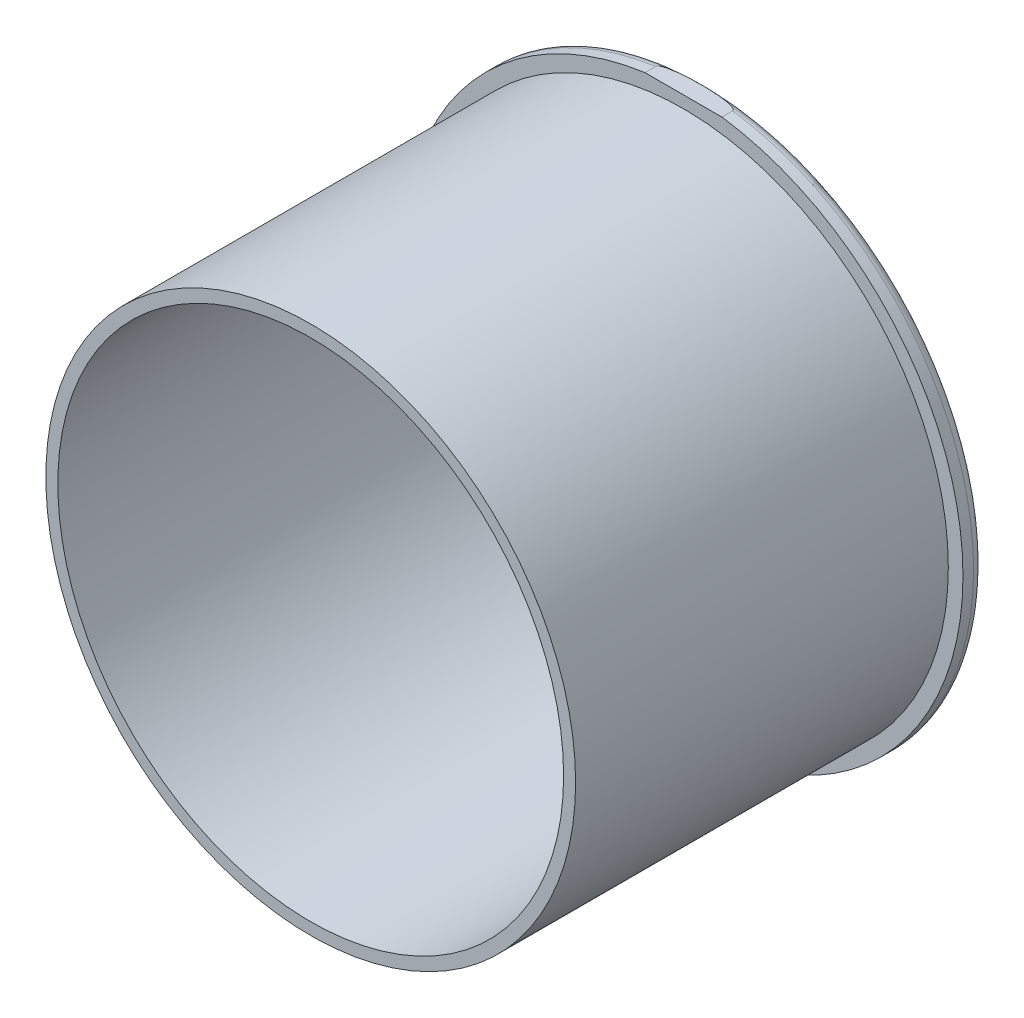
ISO-10303-21;
HEADER;
FILE_DESCRIPTION(('STEP AP214'),'2;1');
FILE_NAME('part.step','',(''),(''),'','','');
FILE_SCHEMA(('AUTOMOTIVE_DESIGN { 1 0 10303 214 1 1 1 1 }'));
ENDSEC;
DATA;
#1=APPLICATION_CONTEXT('core data for automotive mechanical design processes');
#2=APPLICATION_PROTOCOL_DEFINITION('international standard','automotive_design',2000,#1);
#3=PRODUCT_CONTEXT('',#1,'mechanical');
#4=PRODUCT('Part','Part','',(#3));
#5=PRODUCT_RELATED_PRODUCT_CATEGORY('part','',(#4));
#6=PRODUCT_DEFINITION_FORMATION('','',#4);
#7=PRODUCT_DEFINITION_CONTEXT('part definition',#1,'design');
#8=PRODUCT_DEFINITION('design','',#6,#7);
#9=PRODUCT_DEFINITION_SHAPE('','',#8);
#10=(LENGTH_UNIT() NAMED_UNIT(*) SI_UNIT(.MILLI.,.METRE.));
#11=(NAMED_UNIT(*) PLANE_ANGLE_UNIT() SI_UNIT($,.RADIAN.));
#12=(NAMED_UNIT(*) SI_UNIT($,.STERADIAN.) SOLID_ANGLE_UNIT());
#13=UNCERTAINTY_MEASURE_WITH_UNIT(LENGTH_MEASURE(1.E-05),#10,'distance_accuracy_value','');
#14=(GEOMETRIC_REPRESENTATION_CONTEXT(3) GLOBAL_UNCERTAINTY_ASSIGNED_CONTEXT((#13)) GLOBAL_UNIT_ASSIGNED_CONTEXT((#10,
#11,#12)) REPRESENTATION_CONTEXT('',''));
#15=CARTESIAN_POINT('',(0.,0.,0.));
#16=DIRECTION('',(0.,0.,1.));
#17=DIRECTION('',(1.,0.,0.));
#18=AXIS2_PLACEMENT_3D('',#15,#16,#17);
#19=CARTESIAN_POINT('',(0.,0.,0.));
#20=DIRECTION('',(0.,0.,-1.));
#21=DIRECTION('',(-1.,0.,0.));
#22=AXIS2_PLACEMENT_3D('',#19,#20,#21);
#23=PLANE('',#22);
#24=CARTESIAN_POINT('',(0.,0.,0.));
#25=DIRECTION('',(0.,0.,1.));
#26=DIRECTION('',(0.479425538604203,0.877582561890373,0.));
#27=AXIS2_PLACEMENT_3D('',#24,#25,#26);
#28=CIRCLE('',#27,5.05000000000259);
#29=CARTESIAN_POINT('',(2.42109896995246,4.43179193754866,0.));
#30=VERTEX_POINT('',#29);
#31=EDGE_CURVE('E72',#30,#30,#28,.T.);
#32=ORIENTED_EDGE('',*,*,#31,.F.);
#33=EDGE_LOOP('',(#32));
#34=FACE_BOUND('',#33,.T.);
#35=ADVANCED_FACE('F16',(#34),#23,.T.);
#36=CARTESIAN_POINT('',(0.,4.75,0.25));
#37=DIRECTION('',(0.,0.,-1.));
#38=DIRECTION('',(-1.,0.,0.));
#39=AXIS2_PLACEMENT_3D('',#36,#37,#38);
#40=PLANE('',#39);
#41=CARTESIAN_POINT('',(0.,0.,0.25));
#42=DIRECTION('',(0.,0.,1.));
#43=DIRECTION('',(1.,0.,0.));
#44=AXIS2_PLACEMENT_3D('',#41,#42,#43);
#45=CIRCLE('',#44,4.75);
#46=CARTESIAN_POINT('',(4.75,0.,0.25));
#47=VERTEX_POINT('',#46);
#48=EDGE_CURVE('E81',#47,#47,#45,.T.);
#49=ORIENTED_EDGE('',*,*,#48,.T.);
#50=EDGE_LOOP('',(#49));
#51=FACE_BOUND('',#50,.T.);
#52=ADVANCED_FACE('F119',(#51),#40,.F.);
#53=CARTESIAN_POINT('',(0.,0.,0.2));
#54=DIRECTION('',(0.,0.,-1.));
#55=DIRECTION('',(0.479425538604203,0.877582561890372,0.));
#56=AXIS2_PLACEMENT_3D('',#53,#54,#55);
#57=TOROIDAL_SURFACE('',#56,5.05,0.2);
#58=ORIENTED_EDGE('',*,*,#31,.T.);
#59=EDGE_LOOP('',(#58));
#60=FACE_BOUND('',#59,.T.);
#61=CARTESIAN_POINT('',(0.,0.,0.2));
#62=DIRECTION('',(0.,0.,1.));
#63=DIRECTION('',(1.,0.,0.));
#64=AXIS2_PLACEMENT_3D('',#61,#62,#63);
#65=CIRCLE('',#64,5.25);
#66=CARTESIAN_POINT('',(-0.722841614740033,5.2,0.2));
#67=VERTEX_POINT('',#66);
#68=CARTESIAN_POINT('',(-0.722841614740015,-5.2,0.2));
#69=VERTEX_POINT('',#68);
#70=EDGE_CURVE('E70',#67,#69,#65,.T.);
#71=ORIENTED_EDGE('',*,*,#70,.F.);
#72=CARTESIAN_POINT('',(-0.722841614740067,5.2,0.2));
#73=CARTESIAN_POINT('',(-0.722858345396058,5.2,0.196452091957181));
#74=CARTESIAN_POINT('',(-0.722160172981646,5.2,0.19304530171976));
#75=CARTESIAN_POINT('',(-0.719410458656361,5.2,0.185678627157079));
#76=CARTESIAN_POINT('',(-0.717033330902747,5.2,0.181832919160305));
#77=CARTESIAN_POINT('',(-0.711778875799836,5.2,0.175244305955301));
#78=CARTESIAN_POINT('',(-0.708980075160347,5.2,0.172428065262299));
#79=CARTESIAN_POINT('',(-0.703025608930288,5.2,0.16718922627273));
#80=CARTESIAN_POINT('',(-0.699869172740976,5.2,0.164767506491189));
#81=CARTESIAN_POINT('',(-0.691454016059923,5.2,0.158909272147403));
#82=CARTESIAN_POINT('',(-0.686040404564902,5.2,0.155701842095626));
#83=CARTESIAN_POINT('',(-0.674957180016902,5.2,0.149792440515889));
#84=CARTESIAN_POINT('',(-0.669287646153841,5.2,0.147090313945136));
#85=CARTESIAN_POINT('',(-0.651978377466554,5.2,0.139488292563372));
#86=CARTESIAN_POINT('',(-0.640103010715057,5.2,0.135131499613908));
#87=CARTESIAN_POINT('',(-0.615000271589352,5.2,0.126922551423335));
#88=CARTESIAN_POINT('',(-0.601747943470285,5.2,0.123151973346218));
#89=CARTESIAN_POINT('',(-0.57506202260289,5.2,0.116306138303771));
#90=CARTESIAN_POINT('',(-0.561628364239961,5.2,0.113231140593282));
#91=CARTESIAN_POINT('',(-0.521117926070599,5.2,0.104749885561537));
#92=CARTESIAN_POINT('',(-0.493884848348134,5.2,0.10010270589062));
#93=CARTESIAN_POINT('',(-0.439244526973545,5.2,0.0920807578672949));
#94=CARTESIAN_POINT('',(-0.411837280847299,5.19999999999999,0.0887060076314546));
#95=CARTESIAN_POINT('',(-0.35695832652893,5.20000000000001,0.0828896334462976));
#96=CARTESIAN_POINT('',(-0.329486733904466,5.20000000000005,0.0804469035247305));
#97=CARTESIAN_POINT('',(-0.274001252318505,5.19999999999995,0.0762486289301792));
#98=CARTESIAN_POINT('',(-0.245986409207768,5.1999999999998,0.0745060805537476));
#99=CARTESIAN_POINT('',(-0.189916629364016,5.2000000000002,0.0716476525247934));
#100=CARTESIAN_POINT('',(-0.161861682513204,5.20000000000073,0.0705319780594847));
#101=CARTESIAN_POINT('',(-0.0777740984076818,5.19999999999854,0.0680088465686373));
#102=CARTESIAN_POINT('',(-0.021715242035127,5.19999999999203,0.0674181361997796));
#103=CARTESIAN_POINT('',(0.072383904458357,5.19999999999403,0.0681281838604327));
#104=CARTESIAN_POINT('',(0.110429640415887,5.19999999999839,0.0688824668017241));
#105=CARTESIAN_POINT('',(0.186498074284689,5.20000000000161,0.0714267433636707));
#106=CARTESIAN_POINT('',(0.224520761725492,5.20000000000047,0.0732170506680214));
#107=CARTESIAN_POINT('',(0.314091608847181,5.19999999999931,0.0788903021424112));
#108=CARTESIAN_POINT('',(0.365611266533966,5.19999999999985,0.0832928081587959));
#109=CARTESIAN_POINT('',(0.451918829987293,5.2000000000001,0.0936942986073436));
#110=CARTESIAN_POINT('',(0.486815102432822,5.20000000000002,0.0987397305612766));
#111=CARTESIAN_POINT('',(0.545243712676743,5.19999999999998,0.109559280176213));
#112=CARTESIAN_POINT('',(0.568902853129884,5.2,0.114606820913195));
#113=CARTESIAN_POINT('',(0.608457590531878,5.2,0.124974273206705));
#114=CARTESIAN_POINT('',(0.624495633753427,5.20000000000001,0.129729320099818));
#115=CARTESIAN_POINT('',(0.651244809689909,5.2,0.139294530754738));
#116=CARTESIAN_POINT('',(0.662105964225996,5.19999999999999,0.143657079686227));
#117=CARTESIAN_POINT('',(0.678263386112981,5.20000000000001,0.151478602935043));
#118=CARTESIAN_POINT('',(0.683806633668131,5.20000000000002,0.154419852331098));
#119=CARTESIAN_POINT('',(0.694513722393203,5.19999999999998,0.160916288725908));
#120=CARTESIAN_POINT('',(0.699679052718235,5.19999999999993,0.164468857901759));
#121=CARTESIAN_POINT('',(0.708278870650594,5.19999999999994,0.171685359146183));
#122=CARTESIAN_POINT('',(0.71185196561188,5.19999999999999,0.175180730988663));
#123=CARTESIAN_POINT('',(0.717973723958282,5.20000000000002,0.183195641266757));
#124=CARTESIAN_POINT('',(0.72051052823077,5.2,0.187726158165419));
#125=CARTESIAN_POINT('',(0.722498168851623,5.2,0.194977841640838));
#126=CARTESIAN_POINT('',(0.722859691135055,5.2,0.197461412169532));
#127=CARTESIAN_POINT('',(0.722841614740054,5.2,0.199999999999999));
#128=B_SPLINE_CURVE_WITH_KNOTS('',3,(#72,#73,#74,#75,#76,#77,#78,#79,#80,#81,#82,#83,#84,#85,
#86,#87,#88,#89,#90,#91,#92,#93,#94,#95,#96,#97,#98,#99,#100,#101,#102,#103,#104,#105,#106,#107,
#108,#109,#110,#111,#112,#113,#114,#115,#116,#117,#118,#119,#120,#121,#122,#123,#124,#125,#126,
#127),.UNSPECIFIED.,.F.,.F.,(4,2,2,2,2,2,2,2,2,2,2,2,2,2,2,2,2,2,2,2,2,2,2,2,2,2,2,4),(0.,
0.0103569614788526,0.0236287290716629,0.0355096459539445,0.0474166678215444,0.0662496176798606,
0.085076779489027,0.122956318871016,0.164270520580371,0.205600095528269,0.288424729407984,
0.37125054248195,0.453977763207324,0.538176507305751,0.622402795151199,0.790544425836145,
0.904692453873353,1.01887506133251,1.1739140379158,1.27962687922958,1.35213747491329,
1.40226886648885,1.43730705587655,1.45611268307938,1.47483969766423,1.48977048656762,
1.50486765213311,1.51236305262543),.UNSPECIFIED.);
#129=CARTESIAN_POINT('',(0.722841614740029,5.2,0.2));
#130=VERTEX_POINT('',#129);
#131=EDGE_CURVE('E20',#67,#130,#128,.T.);
#132=ORIENTED_EDGE('',*,*,#131,.T.);
#133=CARTESIAN_POINT('',(0.,0.,0.2));
#134=DIRECTION('',(0.,0.,1.));
#135=DIRECTION('',(1.,0.,0.));
#136=AXIS2_PLACEMENT_3D('',#133,#134,#135);
#137=CIRCLE('',#136,5.25);
#138=CARTESIAN_POINT('',(0.72284161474,-5.2,0.2));
#139=VERTEX_POINT('',#138);
#140=EDGE_CURVE('E67',#139,#130,#137,.T.);
#141=ORIENTED_EDGE('',*,*,#140,.F.);
#142=CARTESIAN_POINT('',(0.722841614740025,-5.2,0.2));
#143=CARTESIAN_POINT('',(0.722858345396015,-5.2,0.19645209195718));
#144=CARTESIAN_POINT('',(0.722160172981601,-5.2,0.193045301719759));
#145=CARTESIAN_POINT('',(0.719410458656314,-5.2,0.185678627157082));
#146=CARTESIAN_POINT('',(0.717033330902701,-5.2,0.18183291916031));
#147=CARTESIAN_POINT('',(0.711778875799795,-5.2,0.175244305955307));
#148=CARTESIAN_POINT('',(0.708980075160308,-5.2,0.172428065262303));
#149=CARTESIAN_POINT('',(0.703025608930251,-5.2,0.167189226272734));
#150=CARTESIAN_POINT('',(0.699869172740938,-5.2,0.164767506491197));
#151=CARTESIAN_POINT('',(0.691454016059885,-5.2,0.158909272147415));
#152=CARTESIAN_POINT('',(0.686040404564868,-5.2,0.155701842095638));
#153=CARTESIAN_POINT('',(0.674957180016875,-5.2,0.1497924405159));
#154=CARTESIAN_POINT('',(0.669287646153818,-5.2,0.147090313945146));
#155=CARTESIAN_POINT('',(0.651978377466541,-5.2,0.139488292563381));
#156=CARTESIAN_POINT('',(0.640103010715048,-5.2,0.135131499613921));
#157=CARTESIAN_POINT('',(0.615000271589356,-5.2,0.126922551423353));
#158=CARTESIAN_POINT('',(0.601747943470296,-5.2,0.123151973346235));
#159=CARTESIAN_POINT('',(0.575062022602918,-5.2,0.116306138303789));
#160=CARTESIAN_POINT('',(0.561628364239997,-5.2,0.113231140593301));
#161=CARTESIAN_POINT('',(0.521117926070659,-5.2,0.104749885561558));
#162=CARTESIAN_POINT('',(0.493884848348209,-5.20000000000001,0.100102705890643));
#163=CARTESIAN_POINT('',(0.439244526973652,-5.19999999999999,0.092080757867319));
#164=CARTESIAN_POINT('',(0.411837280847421,-5.19999999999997,0.0887060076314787));
#165=CARTESIAN_POINT('',(0.356958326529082,-5.20000000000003,0.0828896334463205));
#166=CARTESIAN_POINT('',(0.329486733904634,-5.2000000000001,0.0804469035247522));
#167=CARTESIAN_POINT('',(0.274001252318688,-5.19999999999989,0.0762486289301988));
#168=CARTESIAN_POINT('',(0.24598640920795,-5.19999999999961,0.0745060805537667));
#169=CARTESIAN_POINT('',(0.189916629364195,-5.20000000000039,0.0716476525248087));
#170=CARTESIAN_POINT('',(0.161861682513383,-5.20000000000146,0.0705319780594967));
#171=CARTESIAN_POINT('',(0.0777740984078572,-5.19999999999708,0.0680088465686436));
#172=CARTESIAN_POINT('',(0.0217152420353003,-5.19999999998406,0.0674181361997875));
#173=CARTESIAN_POINT('',(-0.0723839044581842,-5.19999999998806,0.0681281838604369));
#174=CARTESIAN_POINT('',(-0.110429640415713,-5.19999999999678,0.068882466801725));
#175=CARTESIAN_POINT('',(-0.186498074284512,-5.20000000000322,0.0714267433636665));
#176=CARTESIAN_POINT('',(-0.224520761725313,-5.20000000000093,0.0732170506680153));
#177=CARTESIAN_POINT('',(-0.314091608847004,-5.19999999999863,0.078890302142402));
#178=CARTESIAN_POINT('',(-0.365611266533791,-5.1999999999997,0.0832928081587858));
#179=CARTESIAN_POINT('',(-0.451918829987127,-5.2000000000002,0.0936942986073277));
#180=CARTESIAN_POINT('',(-0.48681510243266,-5.20000000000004,0.0987397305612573));
#181=CARTESIAN_POINT('',(-0.545243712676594,-5.19999999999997,0.109559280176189));
#182=CARTESIAN_POINT('',(-0.568902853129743,-5.19999999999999,0.11460682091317));
#183=CARTESIAN_POINT('',(-0.60845759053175,-5.20000000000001,0.124974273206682));
#184=CARTESIAN_POINT('',(-0.624495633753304,-5.20000000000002,0.129729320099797));
#185=CARTESIAN_POINT('',(-0.6512448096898,-5.19999999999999,0.139294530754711));
#186=CARTESIAN_POINT('',(-0.662105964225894,-5.19999999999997,0.143657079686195));
#187=CARTESIAN_POINT('',(-0.678263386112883,-5.20000000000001,0.151478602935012));
#188=CARTESIAN_POINT('',(-0.683806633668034,-5.20000000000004,0.154419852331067));
#189=CARTESIAN_POINT('',(-0.694513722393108,-5.19999999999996,0.160916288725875));
#190=CARTESIAN_POINT('',(-0.699679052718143,-5.19999999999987,0.164468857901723));
#191=CARTESIAN_POINT('',(-0.708278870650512,-5.19999999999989,0.171685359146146));
#192=CARTESIAN_POINT('',(-0.711851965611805,-5.19999999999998,0.175180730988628));
#193=CARTESIAN_POINT('',(-0.717973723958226,-5.20000000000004,0.183195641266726));
#194=CARTESIAN_POINT('',(-0.720510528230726,-5.20000000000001,0.187726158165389));
#195=CARTESIAN_POINT('',(-0.722498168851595,-5.19999999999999,0.194977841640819));
#196=CARTESIAN_POINT('',(-0.722859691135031,-5.19999999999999,0.197461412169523));
#197=CARTESIAN_POINT('',(-0.722841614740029,-5.2,0.200000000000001));
#198=B_SPLINE_CURVE_WITH_KNOTS('',3,(#142,#143,#144,#145,#146,#147,#148,#149,#150,#151,#152,
#153,#154,#155,#156,#157,#158,#159,#160,#161,#162,#163,#164,#165,#166,#167,#168,#169,#170,#171,
#172,#173,#174,#175,#176,#177,#178,#179,#180,#181,#182,#183,#184,#185,#186,#187,#188,#189,#190,
#191,#192,#193,#194,#195,#196,#197),.UNSPECIFIED.,.F.,.F.,(4,2,2,2,2,2,2,2,2,2,2,2,2,2,2,2,2,2,
2,2,2,2,2,2,2,2,2,4),(0.,0.0103569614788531,0.0236287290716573,0.035509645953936,
0.0474166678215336,0.0662496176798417,0.0850767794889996,0.122956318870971,0.164270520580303,
0.205600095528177,0.288424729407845,0.371250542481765,0.453977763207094,0.538176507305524,
0.622402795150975,0.790544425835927,0.90469245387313,1.01887506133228,1.17391403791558,
1.27962687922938,1.3521374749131,1.40226886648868,1.4373070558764,1.45611268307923,
1.47483969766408,1.4897704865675,1.504867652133,1.51236305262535),.UNSPECIFIED.);
#199=EDGE_CURVE('E107',#139,#69,#198,.T.);
#200=ORIENTED_EDGE('',*,*,#199,.T.);
#201=EDGE_LOOP('',(#71,#132,#141,#200));
#202=FACE_BOUND('',#201,.T.);
#203=ADVANCED_FACE('F66',(#60,#202),#57,.T.);
#204=CARTESIAN_POINT('',(0.,0.,0.125));
#205=DIRECTION('',(0.,0.,1.));
#206=DIRECTION('',(1.,0.,0.));
#207=AXIS2_PLACEMENT_3D('',#204,#205,#206);
#208=CYLINDRICAL_SURFACE('',#207,4.75);
#209=ORIENTED_EDGE('',*,*,#48,.F.);
#210=EDGE_LOOP('',(#209));
#211=FACE_BOUND('',#210,.T.);
#212=CARTESIAN_POINT('',(0.,0.,7.4));
#213=DIRECTION('',(0.,0.,1.));
#214=DIRECTION('',(1.,0.,0.));
#215=AXIS2_PLACEMENT_3D('',#212,#213,#214);
#216=CIRCLE('',#215,4.75);
#217=CARTESIAN_POINT('',(4.75,0.,7.4));
#218=VERTEX_POINT('',#217);
#219=EDGE_CURVE('E88',#218,#218,#216,.T.);
#220=ORIENTED_EDGE('',*,*,#219,.T.);
#221=EDGE_LOOP('',(#220));
#222=FACE_BOUND('',#221,.T.);
#223=ADVANCED_FACE('F118',(#211,#222),#208,.F.);
#224=CARTESIAN_POINT('',(0.,0.,0.125));
#225=DIRECTION('',(0.,0.,1.));
#226=DIRECTION('',(1.,0.,0.));
#227=AXIS2_PLACEMENT_3D('',#224,#225,#226);
#228=CYLINDRICAL_SURFACE('',#227,5.25);
#229=ORIENTED_EDGE('',*,*,#140,.T.);
#230=DIRECTION('',(0.,0.,1.));
#231=VECTOR('',#230,1.);
#232=CARTESIAN_POINT('',(0.72284161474,5.2,0.));
#233=LINE('',#232,#231);
#234=CARTESIAN_POINT('',(0.722841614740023,5.2,0.4));
#235=VERTEX_POINT('',#234);
#236=EDGE_CURVE('E75',#235,#130,#233,.F.);
#237=ORIENTED_EDGE('',*,*,#236,.F.);
#238=CARTESIAN_POINT('',(0.,0.,0.4));
#239=DIRECTION('',(0.,0.,1.));
#240=DIRECTION('',(1.,0.,0.));
#241=AXIS2_PLACEMENT_3D('',#238,#239,#240);
#242=CIRCLE('',#241,5.25);
#243=CARTESIAN_POINT('',(0.722841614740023,-5.2,0.4));
#244=VERTEX_POINT('',#243);
#245=EDGE_CURVE('E96',#235,#244,#242,.F.);
#246=ORIENTED_EDGE('',*,*,#245,.T.);
#247=DIRECTION('',(0.,0.,1.));
#248=VECTOR('',#247,1.);
#249=CARTESIAN_POINT('',(0.72284161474,-5.2,0.));
#250=LINE('',#249,#248);
#251=EDGE_CURVE('E78',#244,#139,#250,.F.);
#252=ORIENTED_EDGE('',*,*,#251,.T.);
#253=EDGE_LOOP('',(#229,#237,#246,#252));
#254=FACE_BOUND('',#253,.T.);
#255=ADVANCED_FACE('F74',(#254),#228,.T.);
#256=CARTESIAN_POINT('',(1.,-5.2,0.));
#257=DIRECTION('',(0.,1.,0.));
#258=DIRECTION('',(0.,0.,1.));
#259=AXIS2_PLACEMENT_3D('',#256,#257,#258);
#260=PLANE('',#259);
#261=ORIENTED_EDGE('',*,*,#251,.F.);
#262=DIRECTION('',(-1.,0.,0.));
#263=VECTOR('',#262,1.);
#264=CARTESIAN_POINT('',(0.,-5.2,0.4));
#265=LINE('',#264,#263);
#266=CARTESIAN_POINT('',(-0.722841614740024,-5.2,0.4));
#267=VERTEX_POINT('',#266);
#268=EDGE_CURVE('E101',#244,#267,#265,.T.);
#269=ORIENTED_EDGE('',*,*,#268,.T.);
#270=DIRECTION('',(0.,0.,1.));
#271=VECTOR('',#270,1.);
#272=CARTESIAN_POINT('',(-0.722841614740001,-5.20000000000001,0.125));
#273=LINE('',#272,#271);
#274=EDGE_CURVE('E98',#69,#267,#273,.T.);
#275=ORIENTED_EDGE('',*,*,#274,.F.);
#276=ORIENTED_EDGE('',*,*,#199,.F.);
#277=EDGE_LOOP('',(#261,#269,#275,#276));
#278=FACE_BOUND('',#277,.T.);
#279=ADVANCED_FACE('F153',(#278),#260,.F.);
#280=CARTESIAN_POINT('',(0.,0.,0.125));
#281=DIRECTION('',(0.,0.,1.));
#282=DIRECTION('',(1.,0.,0.));
#283=AXIS2_PLACEMENT_3D('',#280,#281,#282);
#284=CYLINDRICAL_SURFACE('',#283,5.25);
#285=ORIENTED_EDGE('',*,*,#70,.T.);
#286=ORIENTED_EDGE('',*,*,#274,.T.);
#287=CARTESIAN_POINT('',(0.,0.,0.4));
#288=DIRECTION('',(0.,0.,1.));
#289=DIRECTION('',(1.,0.,0.));
#290=AXIS2_PLACEMENT_3D('',#287,#288,#289);
#291=CIRCLE('',#290,5.25);
#292=CARTESIAN_POINT('',(-0.722841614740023,5.2,0.4));
#293=VERTEX_POINT('',#292);
#294=EDGE_CURVE('E42',#267,#293,#291,.F.);
#295=ORIENTED_EDGE('',*,*,#294,.T.);
#296=DIRECTION('',(0.,0.,1.));
#297=VECTOR('',#296,1.);
#298=CARTESIAN_POINT('',(-0.72284161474,5.2,0.));
#299=LINE('',#298,#297);
#300=EDGE_CURVE('E89',#67,#293,#299,.T.);
#301=ORIENTED_EDGE('',*,*,#300,.F.);
#302=EDGE_LOOP('',(#285,#286,#295,#301));
#303=FACE_BOUND('',#302,.T.);
#304=ADVANCED_FACE('F155',(#303),#284,.T.);
#305=CARTESIAN_POINT('',(1.,5.2,0.));
#306=DIRECTION('',(0.,1.,0.));
#307=DIRECTION('',(0.,0.,1.));
#308=AXIS2_PLACEMENT_3D('',#305,#306,#307);
#309=PLANE('',#308);
#310=DIRECTION('',(-1.,0.,0.));
#311=VECTOR('',#310,1.);
#312=CARTESIAN_POINT('',(0.,5.2,0.4));
#313=LINE('',#312,#311);
#314=EDGE_CURVE('E85',#293,#235,#313,.F.);
#315=ORIENTED_EDGE('',*,*,#314,.T.);
#316=ORIENTED_EDGE('',*,*,#236,.T.);
#317=ORIENTED_EDGE('',*,*,#131,.F.);
#318=ORIENTED_EDGE('',*,*,#300,.T.);
#319=EDGE_LOOP('',(#315,#316,#317,#318));
#320=FACE_BOUND('',#319,.T.);
#321=ADVANCED_FACE('F83',(#320),#309,.T.);
#322=CARTESIAN_POINT('',(0.,4.975,7.4));
#323=DIRECTION('',(0.,0.,-1.));
#324=DIRECTION('',(-1.,0.,0.));
#325=AXIS2_PLACEMENT_3D('',#322,#323,#324);
#326=PLANE('',#325);
#327=ORIENTED_EDGE('',*,*,#219,.F.);
#328=EDGE_LOOP('',(#327));
#329=FACE_BOUND('',#328,.T.);
#330=CARTESIAN_POINT('',(0.,0.,7.4));
#331=DIRECTION('',(0.,0.,1.));
#332=DIRECTION('',(1.,0.,0.));
#333=AXIS2_PLACEMENT_3D('',#330,#331,#332);
#334=CIRCLE('',#333,4.975);
#335=CARTESIAN_POINT('',(4.975,0.,7.4));
#336=VERTEX_POINT('',#335);
#337=EDGE_CURVE('E33',#336,#336,#334,.F.);
#338=ORIENTED_EDGE('',*,*,#337,.F.);
#339=EDGE_LOOP('',(#338));
#340=FACE_BOUND('',#339,.T.);
#341=ADVANCED_FACE('F166',(#329,#340),#326,.F.);
#342=CARTESIAN_POINT('',(0.,5.25,0.4));
#343=DIRECTION('',(0.,0.,-1.));
#344=DIRECTION('',(-1.,0.,0.));
#345=AXIS2_PLACEMENT_3D('',#342,#343,#344);
#346=PLANE('',#345);
#347=CARTESIAN_POINT('',(0.,0.,0.4));
#348=DIRECTION('',(0.,0.,1.));
#349=DIRECTION('',(1.,0.,0.));
#350=AXIS2_PLACEMENT_3D('',#347,#348,#349);
#351=CIRCLE('',#350,4.975);
#352=CARTESIAN_POINT('',(4.975,0.,0.4));
#353=VERTEX_POINT('',#352);
#354=EDGE_CURVE('E11',#353,#353,#351,.T.);
#355=ORIENTED_EDGE('',*,*,#354,.F.);
#356=EDGE_LOOP('',(#355));
#357=FACE_BOUND('',#356,.T.);
#358=ORIENTED_EDGE('',*,*,#294,.F.);
#359=ORIENTED_EDGE('',*,*,#268,.F.);
#360=ORIENTED_EDGE('',*,*,#245,.F.);
#361=ORIENTED_EDGE('',*,*,#314,.F.);
#362=EDGE_LOOP('',(#358,#359,#360,#361));
#363=FACE_BOUND('',#362,.T.);
#364=ADVANCED_FACE('F156',(#357,#363),#346,.F.);
#365=CARTESIAN_POINT('',(0.,0.,0.125));
#366=DIRECTION('',(0.,0.,1.));
#367=DIRECTION('',(1.,0.,0.));
#368=AXIS2_PLACEMENT_3D('',#365,#366,#367);
#369=CYLINDRICAL_SURFACE('',#368,4.975);
#370=ORIENTED_EDGE('',*,*,#337,.T.);
#371=EDGE_LOOP('',(#370));
#372=FACE_BOUND('',#371,.T.);
#373=ORIENTED_EDGE('',*,*,#354,.T.);
#374=EDGE_LOOP('',(#373));
#375=FACE_BOUND('',#374,.T.);
#376=ADVANCED_FACE('F165',(#372,#375),#369,.T.);
#377=CLOSED_SHELL('',(#35,#52,#203,#223,#255,#279,#304,#321,#341,#364,#376));
#378=MANIFOLD_SOLID_BREP('B1',#377);
#379=ADVANCED_BREP_SHAPE_REPRESENTATION('',(#18,#378),#14);
#380=SHAPE_DEFINITION_REPRESENTATION(#9,#379);
ENDSEC;
END-ISO-10303-21;
